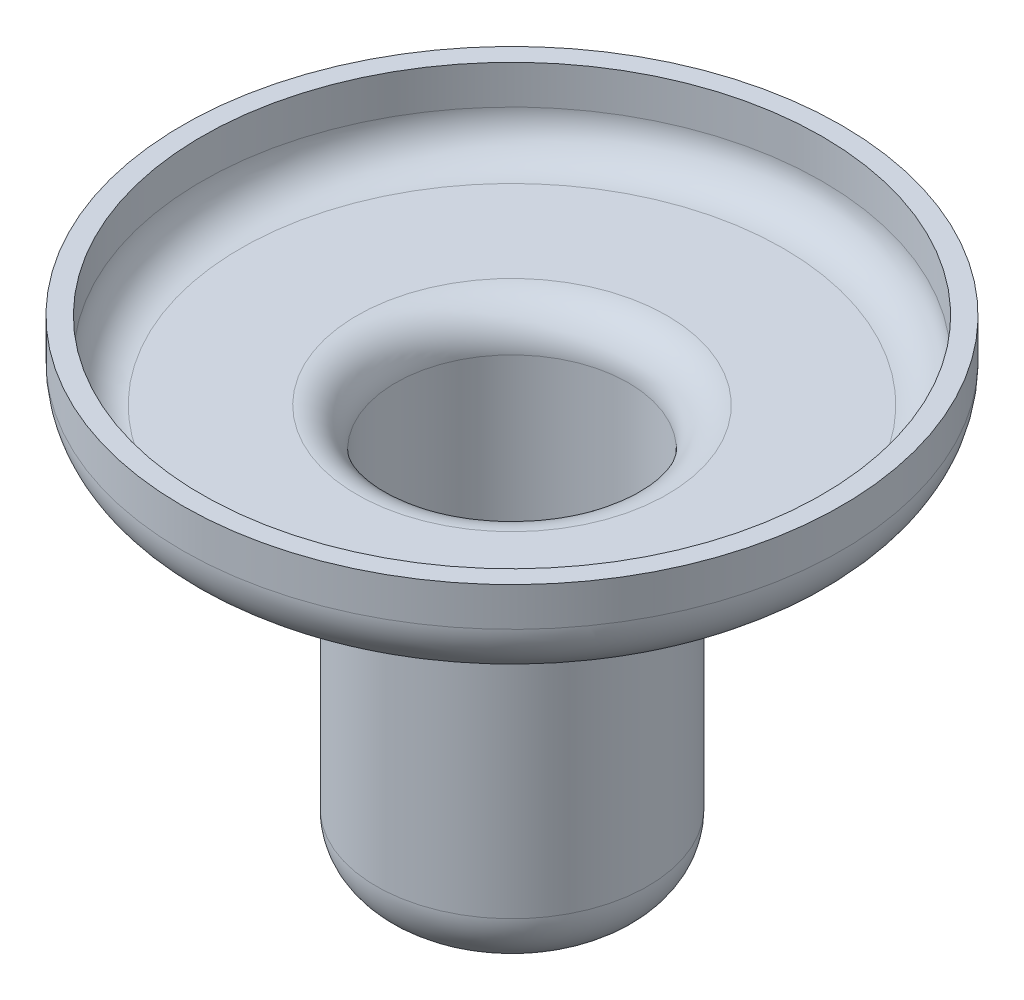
from build123d import *


with BuildPart() as part:
    # Esquisse1 → R_vol.-Mince1 (revolve)
    with BuildSketch(Plane.XY, mode=Mode.PRIVATE) as r_vol_mince1_sk:
        with BuildLine():
            Line((16, 4), (16, 2))
            ThreePointArc((16, 2), (15.414213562, 0.585786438), (14, 0))
            Line((14, 0), (8, 0))
            ThreePointArc((8, 0), (6.585786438, -0.585786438), (6, -2))
            Line((6, -2), (6, -18))
            ThreePointArc((6, -18), (5.414213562, -19.414213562), (4, -20))
            Line((4, -20), (0, -20))
            Line((0, -20), (0, -21))
            Line((0, -21), (4, -21))
            ThreePointArc((4, -21), (6.121320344, -20.121320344), (7, -18))
            Line((7, -18), (7, -2))
            ThreePointArc((7, -2), (7.292893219, -1.292893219), (8, -1))
            Line((8, -1), (14, -1))
            ThreePointArc((14, -1), (16.121320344, -0.121320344), (17, 2))
            Line((17, 2), (17, 4))
            Line((17, 4), (16, 4))
        make_face()
    revolve(r_vol_mince1_sk.sketch.rotate(Axis((0, 0, 0), (0, 1, 0)), 90), axis=Axis((0, 0, 0), (0, 1, 0)))


solid = part.part
